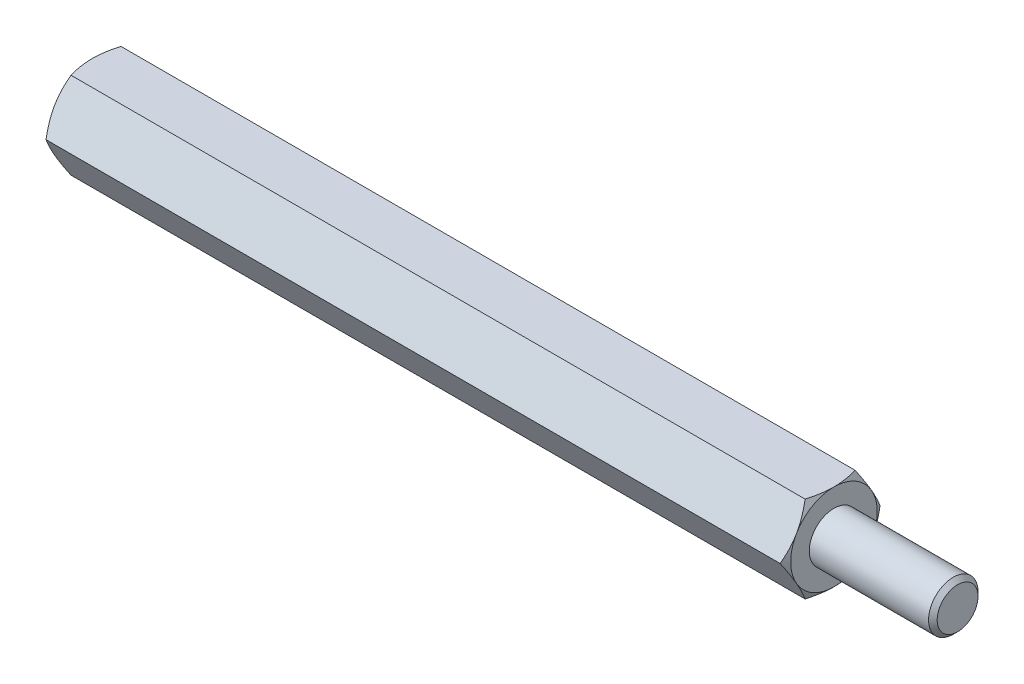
from build123d import *

# Parameters (mm, degrees)
EXTRUDE2_DEPTH = 30
SKETCH3_R      = 1.65
EXTRUDE3_DEPTH = 10
SKETCH5_R      = 2
EXTRUDE4_DEPTH = 10
CHAMFER1_SIZE  = 0.35


with BuildPart() as part:
    # Sketch1 → Extrude2 (new, symmetric)
    with BuildSketch(Plane(origin=(0, 0, 0), x_dir=(0, 0, -1), z_dir=(1, 0, 0))):
        Polygon((2.020725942, 3.5), (-2.020725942, 3.5), (-4.041451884, 0), (-2.020725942, -3.5), (2.020725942, -3.5), (4.041451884, 0), align=None)
    extrude(amount=EXTRUDE2_DEPTH, both=True)

    # Sketch2 → Cut-Revolve1 (revolve, cut)
    with BuildSketch(Plane.XY):
        with BuildLine():
            Line((-30, 3.5), (-28.5, 6.098076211))
            ThreePointArc((-28.5, 6.098076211), (-28.98810136, 7.276457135), (-30, 6.5))
            Line((-30, 6.5), (-30, 3.5))
        make_face()
    cut_revolve1 = revolve(axis=Axis((0, 0, 0), (1, 0, 0)), mode=Mode.SUBTRACT)

    # Mirror1: Cut-Revolve1 across plane
    add(cut_revolve1.mirror(Plane(origin=(0, 0, 0), x_dir=(0, 0, 1), z_dir=(1, 0, 0))), mode=Mode.SUBTRACT)

    # Sketch3 → Extrude3 (cut)
    with BuildSketch(Plane.ZY.offset(30)):
        Circle(SKETCH3_R)
    extrude(amount=-EXTRUDE3_DEPTH, mode=Mode.SUBTRACT)

    # Sketch4 → Cut-Revolve2 (revolve, cut)
    with BuildSketch(Plane.XY, mode=Mode.PRIVATE) as cut_revolve2_sk:
        Polygon((-20, 0), (-20, 1.65), (-19.047372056, 0), align=None)
    revolve(cut_revolve2_sk.sketch.rotate(Axis((-19.047372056, 0, 0), (-1, 0, 0)), 270), axis=Axis((-19.047372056, 0, 0), (-1, 0, 0)), mode=Mode.SUBTRACT)

    # Sketch5 → Extrude4 (add)
    with BuildSketch(Plane(origin=(30, 0, 0), x_dir=(0, 0, -1), z_dir=(1, 0, 0))):
        Circle(SKETCH5_R)
    extrude(amount=EXTRUDE4_DEPTH)

    # Chamfer1
    chamfer1_edges = [part.edges().sort_by_distance(p)[0] for p in [
        (40, 0, 2),
    ]]
    chamfer(chamfer1_edges, length=CHAMFER1_SIZE)


solid = part.part
